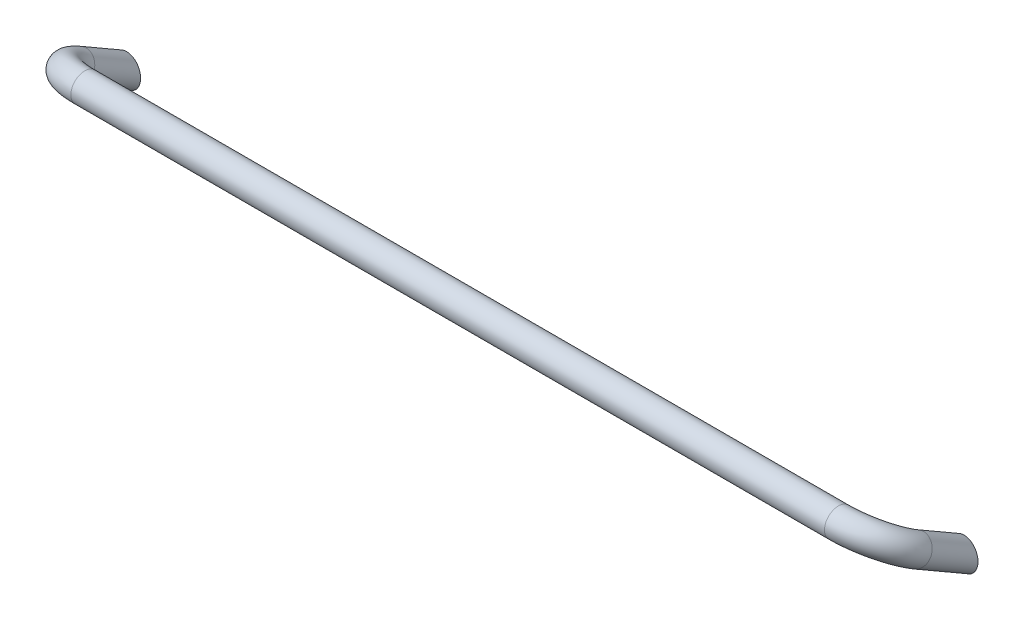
ISO-10303-21;
HEADER;
FILE_DESCRIPTION(('STEP AP214'),'2;1');
FILE_NAME('part.step','',(''),(''),'','','');
FILE_SCHEMA(('AUTOMOTIVE_DESIGN { 1 0 10303 214 1 1 1 1 }'));
ENDSEC;
DATA;
#1=APPLICATION_CONTEXT('core data for automotive mechanical design processes');
#2=APPLICATION_PROTOCOL_DEFINITION('international standard','automotive_design',2000,#1);
#3=PRODUCT_CONTEXT('',#1,'mechanical');
#4=PRODUCT('Part','Part','',(#3));
#5=PRODUCT_RELATED_PRODUCT_CATEGORY('part','',(#4));
#6=PRODUCT_DEFINITION_FORMATION('','',#4);
#7=PRODUCT_DEFINITION_CONTEXT('part definition',#1,'design');
#8=PRODUCT_DEFINITION('design','',#6,#7);
#9=PRODUCT_DEFINITION_SHAPE('','',#8);
#10=(LENGTH_UNIT() NAMED_UNIT(*) SI_UNIT(.MILLI.,.METRE.));
#11=(NAMED_UNIT(*) PLANE_ANGLE_UNIT() SI_UNIT($,.RADIAN.));
#12=(NAMED_UNIT(*) SI_UNIT($,.STERADIAN.) SOLID_ANGLE_UNIT());
#13=UNCERTAINTY_MEASURE_WITH_UNIT(LENGTH_MEASURE(1.E-05),#10,'distance_accuracy_value','');
#14=(GEOMETRIC_REPRESENTATION_CONTEXT(3) GLOBAL_UNCERTAINTY_ASSIGNED_CONTEXT((#13)) GLOBAL_UNIT_ASSIGNED_CONTEXT((#10,
#11,#12)) REPRESENTATION_CONTEXT('',''));
#15=CARTESIAN_POINT('',(0.,0.,0.));
#16=DIRECTION('',(0.,0.,1.));
#17=DIRECTION('',(1.,0.,0.));
#18=AXIS2_PLACEMENT_3D('',#15,#16,#17);
#19=CARTESIAN_POINT('',(600.,0.,1.13690651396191E-10));
#20=DIRECTION('',(0.,0.,-1.));
#21=DIRECTION('',(0.,1.,0.));
#22=AXIS2_PLACEMENT_3D('',#19,#20,#21);
#23=CONICAL_SURFACE('',#22,4.24999999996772,0.785398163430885);
#24=CARTESIAN_POINT('',(600.,0.,0.250000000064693));
#25=DIRECTION('',(0.,0.,-1.));
#26=DIRECTION('',(0.,1.,0.));
#27=AXIS2_PLACEMENT_3D('',#24,#25,#26);
#28=CIRCLE('',#27,4.);
#29=CARTESIAN_POINT('',(600.,4.,0.250000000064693));
#30=VERTEX_POINT('',#29);
#31=EDGE_CURVE('E15',#30,#30,#28,.F.);
#32=ORIENTED_EDGE('',*,*,#31,.T.);
#33=EDGE_LOOP('',(#32));
#34=FACE_BOUND('',#33,.T.);
#35=CARTESIAN_POINT('',(600.,0.,6.8220079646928E-11));
#36=DIRECTION('',(0.,0.,-1.));
#37=DIRECTION('',(0.,1.,0.));
#38=AXIS2_PLACEMENT_3D('',#35,#36,#37);
#39=CIRCLE('',#38,4.25000000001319);
#40=CARTESIAN_POINT('',(600.,4.25000000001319,6.8220079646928E-11));
#41=VERTEX_POINT('',#40);
#42=EDGE_CURVE('E99',#41,#41,#39,.T.);
#43=ORIENTED_EDGE('',*,*,#42,.T.);
#44=EDGE_LOOP('',(#43));
#45=FACE_BOUND('',#44,.T.);
#46=ADVANCED_FACE('F12',(#34,#45),#23,.F.);
#47=CARTESIAN_POINT('',(0.,0.,1.13690651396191E-10));
#48=DIRECTION('',(0.,0.,-1.));
#49=DIRECTION('',(0.,1.,0.));
#50=AXIS2_PLACEMENT_3D('',#47,#48,#49);
#51=CONICAL_SURFACE('',#50,4.24999999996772,0.785398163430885);
#52=CARTESIAN_POINT('',(0.,0.,0.250000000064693));
#53=DIRECTION('',(0.,0.,-1.));
#54=DIRECTION('',(0.,1.,0.));
#55=AXIS2_PLACEMENT_3D('',#52,#53,#54);
#56=CIRCLE('',#55,4.);
#57=CARTESIAN_POINT('',(0.,4.,0.250000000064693));
#58=VERTEX_POINT('',#57);
#59=EDGE_CURVE('E101',#58,#58,#56,.F.);
#60=ORIENTED_EDGE('',*,*,#59,.T.);
#61=EDGE_LOOP('',(#60));
#62=FACE_BOUND('',#61,.T.);
#63=CARTESIAN_POINT('',(0.,0.,6.8220079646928E-11));
#64=DIRECTION('',(0.,0.,-1.));
#65=DIRECTION('',(0.,1.,0.));
#66=AXIS2_PLACEMENT_3D('',#63,#64,#65);
#67=CIRCLE('',#66,4.25000000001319);
#68=CARTESIAN_POINT('',(0.,4.25000000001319,6.8220079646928E-11));
#69=VERTEX_POINT('',#68);
#70=EDGE_CURVE('E96',#69,#69,#67,.T.);
#71=ORIENTED_EDGE('',*,*,#70,.T.);
#72=EDGE_LOOP('',(#71));
#73=FACE_BOUND('',#72,.T.);
#74=ADVANCED_FACE('F60',(#62,#73),#51,.F.);
#75=CARTESIAN_POINT('',(-10.,31.1410161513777,0.));
#76=DIRECTION('',(0.,0.,1.));
#77=DIRECTION('',(0.,-1.,0.));
#78=AXIS2_PLACEMENT_3D('',#75,#76,#77);
#79=PLANE('',#78);
#80=ORIENTED_EDGE('',*,*,#42,.F.);
#81=EDGE_LOOP('',(#80));
#82=FACE_BOUND('',#81,.T.);
#83=CARTESIAN_POINT('',(600.,-3.49999999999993,0.));
#84=DIRECTION('',(0.,0.,1.));
#85=DIRECTION('',(0.,1.,0.));
#86=AXIS2_PLACEMENT_3D('',#83,#84,#85);
#87=ELLIPSE('',#86,11.5470053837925,10.);
#88=CARTESIAN_POINT('',(600.,8.04700538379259,0.));
#89=VERTEX_POINT('',#88);
#90=EDGE_CURVE('E89',#89,#89,#87,.T.);
#91=ORIENTED_EDGE('',*,*,#90,.F.);
#92=EDGE_LOOP('',(#91));
#93=FACE_BOUND('',#92,.T.);
#94=ADVANCED_FACE('F57',(#82,#93),#79,.F.);
#95=CARTESIAN_POINT('',(-10.,31.1410161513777,0.));
#96=DIRECTION('',(0.,0.,1.));
#97=DIRECTION('',(0.,-1.,0.));
#98=AXIS2_PLACEMENT_3D('',#95,#96,#97);
#99=PLANE('',#98);
#100=ORIENTED_EDGE('',*,*,#70,.F.);
#101=EDGE_LOOP('',(#100));
#102=FACE_BOUND('',#101,.T.);
#103=CARTESIAN_POINT('',(0.,-3.49999999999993,0.));
#104=DIRECTION('',(0.,0.,1.));
#105=DIRECTION('',(0.,1.,0.));
#106=AXIS2_PLACEMENT_3D('',#103,#104,#105);
#107=ELLIPSE('',#106,11.5470053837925,10.);
#108=CARTESIAN_POINT('',(0.,8.04700538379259,0.));
#109=VERTEX_POINT('',#108);
#110=EDGE_CURVE('E85',#109,#109,#107,.T.);
#111=ORIENTED_EDGE('',*,*,#110,.F.);
#112=EDGE_LOOP('',(#111));
#113=FACE_BOUND('',#112,.T.);
#114=ADVANCED_FACE('F53',(#102,#113),#99,.F.);
#115=CARTESIAN_POINT('',(600.,16.1410161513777,34.0192378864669));
#116=DIRECTION('',(0.,0.5,0.866025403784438));
#117=DIRECTION('',(0.,-0.866025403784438,0.5));
#118=AXIS2_PLACEMENT_3D('',#115,#116,#117);
#119=CYLINDRICAL_SURFACE('',#118,10.);
#120=CARTESIAN_POINT('',(600.,16.1410161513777,34.0192378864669));
#121=DIRECTION('',(0.,-0.5,-0.866025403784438));
#122=DIRECTION('',(1.,0.,0.));
#123=AXIS2_PLACEMENT_3D('',#120,#121,#122);
#124=CIRCLE('',#123,10.);
#125=CARTESIAN_POINT('',(610.,16.1410161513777,34.0192378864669));
#126=VERTEX_POINT('',#125);
#127=EDGE_CURVE('E84',#126,#126,#124,.F.);
#128=ORIENTED_EDGE('',*,*,#127,.F.);
#129=EDGE_LOOP('',(#128));
#130=FACE_BOUND('',#129,.T.);
#131=ORIENTED_EDGE('',*,*,#90,.T.);
#132=EDGE_LOOP('',(#131));
#133=FACE_BOUND('',#132,.T.);
#134=ADVANCED_FACE('F49',(#130,#133),#119,.T.);
#135=CARTESIAN_POINT('',(0.,16.1410161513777,34.0192378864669));
#136=DIRECTION('',(0.,0.5,0.866025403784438));
#137=DIRECTION('',(0.,-0.866025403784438,0.5));
#138=AXIS2_PLACEMENT_3D('',#135,#136,#137);
#139=CYLINDRICAL_SURFACE('',#138,10.);
#140=ORIENTED_EDGE('',*,*,#110,.T.);
#141=EDGE_LOOP('',(#140));
#142=FACE_BOUND('',#141,.T.);
#143=CARTESIAN_POINT('',(0.,16.1410161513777,34.0192378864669));
#144=DIRECTION('',(0.,-0.5,-0.866025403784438));
#145=DIRECTION('',(-1.,0.,0.));
#146=AXIS2_PLACEMENT_3D('',#143,#144,#145);
#147=CIRCLE('',#146,10.);
#148=CARTESIAN_POINT('',(-10.0000000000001,16.1410161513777,34.0192378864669));
#149=VERTEX_POINT('',#148);
#150=EDGE_CURVE('E24',#149,#149,#147,.F.);
#151=ORIENTED_EDGE('',*,*,#150,.F.);
#152=EDGE_LOOP('',(#151));
#153=FACE_BOUND('',#152,.T.);
#154=ADVANCED_FACE('F45',(#142,#153),#139,.T.);
#155=CARTESIAN_POINT('',(570.,16.1410161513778,34.0192378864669));
#156=DIRECTION('',(0.,0.866025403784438,-0.5));
#157=DIRECTION('',(0.,0.5,0.866025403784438));
#158=AXIS2_PLACEMENT_3D('',#155,#156,#157);
#159=TOROIDAL_SURFACE('',#158,30.,10.);
#160=CARTESIAN_POINT('',(570.,31.1410161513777,60.));
#161=DIRECTION('',(1.,0.,0.));
#162=DIRECTION('',(0.,1.,0.));
#163=AXIS2_PLACEMENT_3D('',#160,#161,#162);
#164=CIRCLE('',#163,10.);
#165=CARTESIAN_POINT('',(570.,41.1410161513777,60.));
#166=VERTEX_POINT('',#165);
#167=EDGE_CURVE('E19',#166,#166,#164,.F.);
#168=ORIENTED_EDGE('',*,*,#167,.F.);
#169=EDGE_LOOP('',(#168));
#170=FACE_BOUND('',#169,.T.);
#171=ORIENTED_EDGE('',*,*,#127,.T.);
#172=EDGE_LOOP('',(#171));
#173=FACE_BOUND('',#172,.T.);
#174=ADVANCED_FACE('F40',(#170,#173),#159,.T.);
#175=CARTESIAN_POINT('',(30.,16.1410161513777,34.0192378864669));
#176=DIRECTION('',(0.,-0.866025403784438,0.5));
#177=DIRECTION('',(0.,-0.5,-0.866025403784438));
#178=AXIS2_PLACEMENT_3D('',#175,#176,#177);
#179=TOROIDAL_SURFACE('',#178,30.,10.);
#180=CARTESIAN_POINT('',(30.,31.1410161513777,60.));
#181=DIRECTION('',(1.,0.,0.));
#182=DIRECTION('',(0.,1.,0.));
#183=AXIS2_PLACEMENT_3D('',#180,#181,#182);
#184=CIRCLE('',#183,10.);
#185=CARTESIAN_POINT('',(30.,41.1410161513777,60.));
#186=VERTEX_POINT('',#185);
#187=EDGE_CURVE('E8',#186,#186,#184,.T.);
#188=ORIENTED_EDGE('',*,*,#187,.F.);
#189=EDGE_LOOP('',(#188));
#190=FACE_BOUND('',#189,.T.);
#191=ORIENTED_EDGE('',*,*,#150,.T.);
#192=EDGE_LOOP('',(#191));
#193=FACE_BOUND('',#192,.T.);
#194=ADVANCED_FACE('F35',(#190,#193),#179,.T.);
#195=CARTESIAN_POINT('',(570.,31.1410161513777,60.));
#196=DIRECTION('',(1.,0.,0.));
#197=DIRECTION('',(0.,1.,0.));
#198=AXIS2_PLACEMENT_3D('',#195,#196,#197);
#199=CYLINDRICAL_SURFACE('',#198,10.);
#200=ORIENTED_EDGE('',*,*,#167,.T.);
#201=EDGE_LOOP('',(#200));
#202=FACE_BOUND('',#201,.T.);
#203=ORIENTED_EDGE('',*,*,#187,.T.);
#204=EDGE_LOOP('',(#203));
#205=FACE_BOUND('',#204,.T.);
#206=ADVANCED_FACE('F39',(#202,#205),#199,.T.);
#207=CARTESIAN_POINT('',(0.,0.,12.));
#208=DIRECTION('',(0.,0.,-1.));
#209=DIRECTION('',(0.,1.,0.));
#210=AXIS2_PLACEMENT_3D('',#207,#208,#209);
#211=PLANE('',#210);
#212=CARTESIAN_POINT('',(0.,0.,12.));
#213=DIRECTION('',(0.,0.,-1.));
#214=DIRECTION('',(0.,1.,0.));
#215=AXIS2_PLACEMENT_3D('',#212,#213,#214);
#216=CIRCLE('',#215,4.);
#217=CARTESIAN_POINT('',(0.,4.,12.));
#218=VERTEX_POINT('',#217);
#219=EDGE_CURVE('E27',#218,#218,#216,.T.);
#220=ORIENTED_EDGE('',*,*,#219,.T.);
#221=EDGE_LOOP('',(#220));
#222=FACE_BOUND('',#221,.T.);
#223=ADVANCED_FACE('F69',(#222),#211,.T.);
#224=CARTESIAN_POINT('',(0.,0.,12.));
#225=DIRECTION('',(0.,0.,-1.));
#226=DIRECTION('',(0.,1.,0.));
#227=AXIS2_PLACEMENT_3D('',#224,#225,#226);
#228=CYLINDRICAL_SURFACE('',#227,4.);
#229=ORIENTED_EDGE('',*,*,#219,.F.);
#230=EDGE_LOOP('',(#229));
#231=FACE_BOUND('',#230,.T.);
#232=ORIENTED_EDGE('',*,*,#59,.F.);
#233=EDGE_LOOP('',(#232));
#234=FACE_BOUND('',#233,.T.);
#235=ADVANCED_FACE('F77',(#231,#234),#228,.F.);
#236=CARTESIAN_POINT('',(600.,0.,12.));
#237=DIRECTION('',(0.,0.,-1.));
#238=DIRECTION('',(0.,1.,0.));
#239=AXIS2_PLACEMENT_3D('',#236,#237,#238);
#240=PLANE('',#239);
#241=CARTESIAN_POINT('',(600.,0.,12.));
#242=DIRECTION('',(0.,0.,-1.));
#243=DIRECTION('',(0.,1.,0.));
#244=AXIS2_PLACEMENT_3D('',#241,#242,#243);
#245=CIRCLE('',#244,4.);
#246=CARTESIAN_POINT('',(600.,4.,12.));
#247=VERTEX_POINT('',#246);
#248=EDGE_CURVE('E102',#247,#247,#245,.T.);
#249=ORIENTED_EDGE('',*,*,#248,.T.);
#250=EDGE_LOOP('',(#249));
#251=FACE_BOUND('',#250,.T.);
#252=ADVANCED_FACE('F113',(#251),#240,.T.);
#253=CARTESIAN_POINT('',(600.,0.,12.));
#254=DIRECTION('',(0.,0.,-1.));
#255=DIRECTION('',(0.,1.,0.));
#256=AXIS2_PLACEMENT_3D('',#253,#254,#255);
#257=CYLINDRICAL_SURFACE('',#256,4.);
#258=ORIENTED_EDGE('',*,*,#248,.F.);
#259=EDGE_LOOP('',(#258));
#260=FACE_BOUND('',#259,.T.);
#261=ORIENTED_EDGE('',*,*,#31,.F.);
#262=EDGE_LOOP('',(#261));
#263=FACE_BOUND('',#262,.T.);
#264=ADVANCED_FACE('F117',(#260,#263),#257,.F.);
#265=CLOSED_SHELL('',(#46,#74,#94,#114,#134,#154,#174,#194,#206,#223,#235,#252,#264));
#266=MANIFOLD_SOLID_BREP('B1',#265);
#267=ADVANCED_BREP_SHAPE_REPRESENTATION('',(#18,#266),#14);
#268=SHAPE_DEFINITION_REPRESENTATION(#9,#267);
ENDSEC;
END-ISO-10303-21;
